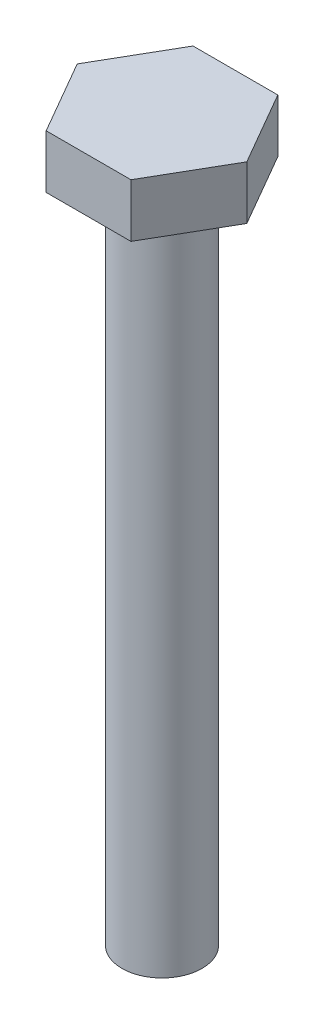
ISO-10303-21;
HEADER;
FILE_DESCRIPTION(('STEP AP214'),'2;1');
FILE_NAME('part.step','',(''),(''),'','','');
FILE_SCHEMA(('AUTOMOTIVE_DESIGN { 1 0 10303 214 1 1 1 1 }'));
ENDSEC;
DATA;
#1=APPLICATION_CONTEXT('core data for automotive mechanical design processes');
#2=APPLICATION_PROTOCOL_DEFINITION('international standard','automotive_design',2000,#1);
#3=PRODUCT_CONTEXT('',#1,'mechanical');
#4=PRODUCT('Part','Part','',(#3));
#5=PRODUCT_RELATED_PRODUCT_CATEGORY('part','',(#4));
#6=PRODUCT_DEFINITION_FORMATION('','',#4);
#7=PRODUCT_DEFINITION_CONTEXT('part definition',#1,'design');
#8=PRODUCT_DEFINITION('design','',#6,#7);
#9=PRODUCT_DEFINITION_SHAPE('','',#8);
#10=(LENGTH_UNIT() NAMED_UNIT(*) SI_UNIT(.MILLI.,.METRE.));
#11=(NAMED_UNIT(*) PLANE_ANGLE_UNIT() SI_UNIT($,.RADIAN.));
#12=(NAMED_UNIT(*) SI_UNIT($,.STERADIAN.) SOLID_ANGLE_UNIT());
#13=UNCERTAINTY_MEASURE_WITH_UNIT(LENGTH_MEASURE(1.E-05),#10,'distance_accuracy_value','');
#14=(GEOMETRIC_REPRESENTATION_CONTEXT(3) GLOBAL_UNCERTAINTY_ASSIGNED_CONTEXT((#13)) GLOBAL_UNIT_ASSIGNED_CONTEXT((#10,
#11,#12)) REPRESENTATION_CONTEXT('',''));
#15=CARTESIAN_POINT('',(0.,0.,0.));
#16=DIRECTION('',(0.,0.,1.));
#17=DIRECTION('',(1.,0.,0.));
#18=AXIS2_PLACEMENT_3D('',#15,#16,#17);
#19=CARTESIAN_POINT('',(3.17542648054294,0.,0.));
#20=DIRECTION('',(0.,1.,0.));
#21=DIRECTION('',(0.,0.,1.));
#22=AXIS2_PLACEMENT_3D('',#19,#20,#21);
#23=PLANE('',#22);
#24=DIRECTION('',(0.5,0.,-0.866025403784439));
#25=VECTOR('',#24,1.);
#26=CARTESIAN_POINT('',(1.58771324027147,0.,2.75));
#27=LINE('',#26,#25);
#28=CARTESIAN_POINT('',(1.58771324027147,0.,2.75));
#29=VERTEX_POINT('',#28);
#30=CARTESIAN_POINT('',(3.17542648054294,0.,0.));
#31=VERTEX_POINT('',#30);
#32=EDGE_CURVE('E118',#29,#31,#27,.T.);
#33=ORIENTED_EDGE('',*,*,#32,.F.);
#34=DIRECTION('',(1.,0.,0.));
#35=VECTOR('',#34,1.);
#36=CARTESIAN_POINT('',(-1.58771324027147,0.,2.75));
#37=LINE('',#36,#35);
#38=CARTESIAN_POINT('',(-1.58771324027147,0.,2.75));
#39=VERTEX_POINT('',#38);
#40=EDGE_CURVE('E78',#39,#29,#37,.T.);
#41=ORIENTED_EDGE('',*,*,#40,.F.);
#42=DIRECTION('',(0.5,0.,0.866025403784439));
#43=VECTOR('',#42,1.);
#44=CARTESIAN_POINT('',(-3.17542648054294,0.,0.));
#45=LINE('',#44,#43);
#46=CARTESIAN_POINT('',(-3.17542648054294,0.,0.));
#47=VERTEX_POINT('',#46);
#48=EDGE_CURVE('E72',#47,#39,#45,.T.);
#49=ORIENTED_EDGE('',*,*,#48,.F.);
#50=DIRECTION('',(-0.5,0.,0.866025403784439));
#51=VECTOR('',#50,1.);
#52=CARTESIAN_POINT('',(-1.58771324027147,0.,-2.75));
#53=LINE('',#52,#51);
#54=CARTESIAN_POINT('',(-1.58771324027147,0.,-2.75));
#55=VERTEX_POINT('',#54);
#56=EDGE_CURVE('E108',#55,#47,#53,.T.);
#57=ORIENTED_EDGE('',*,*,#56,.F.);
#58=DIRECTION('',(-1.,0.,0.));
#59=VECTOR('',#58,1.);
#60=CARTESIAN_POINT('',(1.58771324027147,0.,-2.75));
#61=LINE('',#60,#59);
#62=CARTESIAN_POINT('',(1.58771324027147,0.,-2.75));
#63=VERTEX_POINT('',#62);
#64=EDGE_CURVE('E124',#63,#55,#61,.T.);
#65=ORIENTED_EDGE('',*,*,#64,.F.);
#66=DIRECTION('',(-0.5,0.,-0.866025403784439));
#67=VECTOR('',#66,1.);
#68=CARTESIAN_POINT('',(3.17542648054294,0.,0.));
#69=LINE('',#68,#67);
#70=EDGE_CURVE('E121',#31,#63,#69,.T.);
#71=ORIENTED_EDGE('',*,*,#70,.F.);
#72=EDGE_LOOP('',(#33,#41,#49,#57,#65,#71));
#73=FACE_BOUND('',#72,.T.);
#74=CARTESIAN_POINT('',(0.,0.,0.));
#75=DIRECTION('',(0.,1.,0.));
#76=DIRECTION('',(0.,0.,1.));
#77=AXIS2_PLACEMENT_3D('',#74,#75,#76);
#78=CIRCLE('',#77,1.5);
#79=CARTESIAN_POINT('',(0.,0.,1.5));
#80=VERTEX_POINT('',#79);
#81=EDGE_CURVE('E11',#80,#80,#78,.F.);
#82=ORIENTED_EDGE('',*,*,#81,.F.);
#83=EDGE_LOOP('',(#82));
#84=FACE_BOUND('',#83,.T.);
#85=ADVANCED_FACE('F32',(#73,#84),#23,.F.);
#86=CARTESIAN_POINT('',(1.58771324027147,2.,2.75));
#87=DIRECTION('',(-0.866025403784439,0.,-0.5));
#88=DIRECTION('',(-0.5,0.,0.866025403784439));
#89=AXIS2_PLACEMENT_3D('',#86,#87,#88);
#90=PLANE('',#89);
#91=ORIENTED_EDGE('',*,*,#32,.T.);
#92=DIRECTION('',(0.,-1.,0.));
#93=VECTOR('',#92,1.);
#94=CARTESIAN_POINT('',(3.17542648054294,2.,0.));
#95=LINE('',#94,#93);
#96=CARTESIAN_POINT('',(3.17542648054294,2.,0.));
#97=VERTEX_POINT('',#96);
#98=EDGE_CURVE('E41',#97,#31,#95,.T.);
#99=ORIENTED_EDGE('',*,*,#98,.F.);
#100=DIRECTION('',(0.5,0.,-0.866025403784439));
#101=VECTOR('',#100,1.);
#102=CARTESIAN_POINT('',(1.58771324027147,2.,2.75));
#103=LINE('',#102,#101);
#104=CARTESIAN_POINT('',(1.58771324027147,2.,2.75));
#105=VERTEX_POINT('',#104);
#106=EDGE_CURVE('E129',#105,#97,#103,.T.);
#107=ORIENTED_EDGE('',*,*,#106,.F.);
#108=DIRECTION('',(0.,-1.,0.));
#109=VECTOR('',#108,1.);
#110=CARTESIAN_POINT('',(1.58771324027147,2.,2.75));
#111=LINE('',#110,#109);
#112=EDGE_CURVE('E114',#105,#29,#111,.T.);
#113=ORIENTED_EDGE('',*,*,#112,.T.);
#114=EDGE_LOOP('',(#91,#99,#107,#113));
#115=FACE_BOUND('',#114,.T.);
#116=ADVANCED_FACE('F34',(#115),#90,.F.);
#117=CARTESIAN_POINT('',(3.17542648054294,2.,0.));
#118=DIRECTION('',(-0.866025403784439,0.,0.5));
#119=DIRECTION('',(0.5,0.,0.866025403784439));
#120=AXIS2_PLACEMENT_3D('',#117,#118,#119);
#121=PLANE('',#120);
#122=ORIENTED_EDGE('',*,*,#70,.T.);
#123=DIRECTION('',(0.,-1.,0.));
#124=VECTOR('',#123,1.);
#125=CARTESIAN_POINT('',(1.58771324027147,2.,-2.75));
#126=LINE('',#125,#124);
#127=CARTESIAN_POINT('',(1.58771324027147,2.,-2.75));
#128=VERTEX_POINT('',#127);
#129=EDGE_CURVE('E133',#128,#63,#126,.T.);
#130=ORIENTED_EDGE('',*,*,#129,.F.);
#131=DIRECTION('',(-0.5,0.,-0.866025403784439));
#132=VECTOR('',#131,1.);
#133=CARTESIAN_POINT('',(3.17542648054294,2.,0.));
#134=LINE('',#133,#132);
#135=EDGE_CURVE('E87',#97,#128,#134,.T.);
#136=ORIENTED_EDGE('',*,*,#135,.F.);
#137=ORIENTED_EDGE('',*,*,#98,.T.);
#138=EDGE_LOOP('',(#122,#130,#136,#137));
#139=FACE_BOUND('',#138,.T.);
#140=ADVANCED_FACE('F136',(#139),#121,.F.);
#141=CARTESIAN_POINT('',(1.58771324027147,2.,-2.75));
#142=DIRECTION('',(0.,0.,1.));
#143=DIRECTION('',(1.,0.,0.));
#144=AXIS2_PLACEMENT_3D('',#141,#142,#143);
#145=PLANE('',#144);
#146=ORIENTED_EDGE('',*,*,#64,.T.);
#147=DIRECTION('',(0.,-1.,0.));
#148=VECTOR('',#147,1.);
#149=CARTESIAN_POINT('',(-1.58771324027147,2.,-2.75));
#150=LINE('',#149,#148);
#151=CARTESIAN_POINT('',(-1.58771324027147,2.,-2.75));
#152=VERTEX_POINT('',#151);
#153=EDGE_CURVE('E109',#152,#55,#150,.T.);
#154=ORIENTED_EDGE('',*,*,#153,.F.);
#155=DIRECTION('',(-1.,0.,0.));
#156=VECTOR('',#155,1.);
#157=CARTESIAN_POINT('',(1.58771324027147,2.,-2.75));
#158=LINE('',#157,#156);
#159=EDGE_CURVE('E100',#128,#152,#158,.T.);
#160=ORIENTED_EDGE('',*,*,#159,.F.);
#161=ORIENTED_EDGE('',*,*,#129,.T.);
#162=EDGE_LOOP('',(#146,#154,#160,#161));
#163=FACE_BOUND('',#162,.T.);
#164=ADVANCED_FACE('F144',(#163),#145,.F.);
#165=CARTESIAN_POINT('',(-1.58771324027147,2.,-2.75));
#166=DIRECTION('',(0.866025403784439,0.,0.5));
#167=DIRECTION('',(0.5,0.,-0.866025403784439));
#168=AXIS2_PLACEMENT_3D('',#165,#166,#167);
#169=PLANE('',#168);
#170=ORIENTED_EDGE('',*,*,#56,.T.);
#171=DIRECTION('',(0.,-1.,0.));
#172=VECTOR('',#171,1.);
#173=CARTESIAN_POINT('',(-3.17542648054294,2.,0.));
#174=LINE('',#173,#172);
#175=CARTESIAN_POINT('',(-3.17542648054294,2.,0.));
#176=VERTEX_POINT('',#175);
#177=EDGE_CURVE('E105',#176,#47,#174,.T.);
#178=ORIENTED_EDGE('',*,*,#177,.F.);
#179=DIRECTION('',(-0.5,0.,0.866025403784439));
#180=VECTOR('',#179,1.);
#181=CARTESIAN_POINT('',(-1.58771324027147,2.,-2.75));
#182=LINE('',#181,#180);
#183=EDGE_CURVE('E94',#152,#176,#182,.T.);
#184=ORIENTED_EDGE('',*,*,#183,.F.);
#185=ORIENTED_EDGE('',*,*,#153,.T.);
#186=EDGE_LOOP('',(#170,#178,#184,#185));
#187=FACE_BOUND('',#186,.T.);
#188=ADVANCED_FACE('F106',(#187),#169,.F.);
#189=CARTESIAN_POINT('',(-3.17542648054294,2.,0.));
#190=DIRECTION('',(0.866025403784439,0.,-0.5));
#191=DIRECTION('',(-0.5,0.,-0.866025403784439));
#192=AXIS2_PLACEMENT_3D('',#189,#190,#191);
#193=PLANE('',#192);
#194=ORIENTED_EDGE('',*,*,#48,.T.);
#195=DIRECTION('',(0.,-1.,0.));
#196=VECTOR('',#195,1.);
#197=CARTESIAN_POINT('',(-1.58771324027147,2.,2.75));
#198=LINE('',#197,#196);
#199=CARTESIAN_POINT('',(-1.58771324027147,2.,2.75));
#200=VERTEX_POINT('',#199);
#201=EDGE_CURVE('E110',#200,#39,#198,.T.);
#202=ORIENTED_EDGE('',*,*,#201,.F.);
#203=DIRECTION('',(0.5,0.,0.866025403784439));
#204=VECTOR('',#203,1.);
#205=CARTESIAN_POINT('',(-3.17542648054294,2.,0.));
#206=LINE('',#205,#204);
#207=EDGE_CURVE('E98',#176,#200,#206,.T.);
#208=ORIENTED_EDGE('',*,*,#207,.F.);
#209=ORIENTED_EDGE('',*,*,#177,.T.);
#210=EDGE_LOOP('',(#194,#202,#208,#209));
#211=FACE_BOUND('',#210,.T.);
#212=ADVANCED_FACE('F112',(#211),#193,.F.);
#213=CARTESIAN_POINT('',(-1.58771324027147,2.,2.75));
#214=DIRECTION('',(0.,0.,-1.));
#215=DIRECTION('',(-1.,0.,0.));
#216=AXIS2_PLACEMENT_3D('',#213,#214,#215);
#217=PLANE('',#216);
#218=ORIENTED_EDGE('',*,*,#40,.T.);
#219=ORIENTED_EDGE('',*,*,#112,.F.);
#220=DIRECTION('',(1.,0.,0.));
#221=VECTOR('',#220,1.);
#222=CARTESIAN_POINT('',(-1.58771324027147,2.,2.75));
#223=LINE('',#222,#221);
#224=EDGE_CURVE('E49',#200,#105,#223,.T.);
#225=ORIENTED_EDGE('',*,*,#224,.F.);
#226=ORIENTED_EDGE('',*,*,#201,.T.);
#227=EDGE_LOOP('',(#218,#219,#225,#226));
#228=FACE_BOUND('',#227,.T.);
#229=ADVANCED_FACE('F165',(#228),#217,.F.);
#230=CARTESIAN_POINT('',(3.17542648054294,2.,0.));
#231=DIRECTION('',(0.,1.,0.));
#232=DIRECTION('',(0.,0.,1.));
#233=AXIS2_PLACEMENT_3D('',#230,#231,#232);
#234=PLANE('',#233);
#235=ORIENTED_EDGE('',*,*,#106,.T.);
#236=ORIENTED_EDGE('',*,*,#135,.T.);
#237=ORIENTED_EDGE('',*,*,#159,.T.);
#238=ORIENTED_EDGE('',*,*,#183,.T.);
#239=ORIENTED_EDGE('',*,*,#207,.T.);
#240=ORIENTED_EDGE('',*,*,#224,.T.);
#241=EDGE_LOOP('',(#235,#236,#237,#238,#239,#240));
#242=FACE_BOUND('',#241,.T.);
#243=ADVANCED_FACE('F96',(#242),#234,.T.);
#244=CARTESIAN_POINT('',(0.,-25.,0.));
#245=DIRECTION('',(0.,1.,0.));
#246=DIRECTION('',(0.,0.,1.));
#247=AXIS2_PLACEMENT_3D('',#244,#245,#246);
#248=CYLINDRICAL_SURFACE('',#247,1.5);
#249=CARTESIAN_POINT('',(0.,-25.,0.));
#250=DIRECTION('',(0.,-1.,0.));
#251=DIRECTION('',(0.,0.,-1.));
#252=AXIS2_PLACEMENT_3D('',#249,#250,#251);
#253=CIRCLE('',#252,1.5);
#254=CARTESIAN_POINT('',(0.,-25.,-1.5));
#255=VERTEX_POINT('',#254);
#256=EDGE_CURVE('E122',#255,#255,#253,.T.);
#257=ORIENTED_EDGE('',*,*,#256,.F.);
#258=EDGE_LOOP('',(#257));
#259=FACE_BOUND('',#258,.T.);
#260=ORIENTED_EDGE('',*,*,#81,.T.);
#261=EDGE_LOOP('',(#260));
#262=FACE_BOUND('',#261,.T.);
#263=ADVANCED_FACE('F153',(#259,#262),#248,.T.);
#264=CARTESIAN_POINT('',(0.,-25.,0.));
#265=DIRECTION('',(0.,-1.,0.));
#266=DIRECTION('',(0.,0.,-1.));
#267=AXIS2_PLACEMENT_3D('',#264,#265,#266);
#268=PLANE('',#267);
#269=ORIENTED_EDGE('',*,*,#256,.T.);
#270=EDGE_LOOP('',(#269));
#271=FACE_BOUND('',#270,.T.);
#272=ADVANCED_FACE('F151',(#271),#268,.T.);
#273=CLOSED_SHELL('',(#85,#116,#140,#164,#188,#212,#229,#243,#263,#272));
#274=MANIFOLD_SOLID_BREP('B2',#273);
#275=ADVANCED_BREP_SHAPE_REPRESENTATION('',(#18,#274),#14);
#276=SHAPE_DEFINITION_REPRESENTATION(#9,#275);
ENDSEC;
END-ISO-10303-21;
